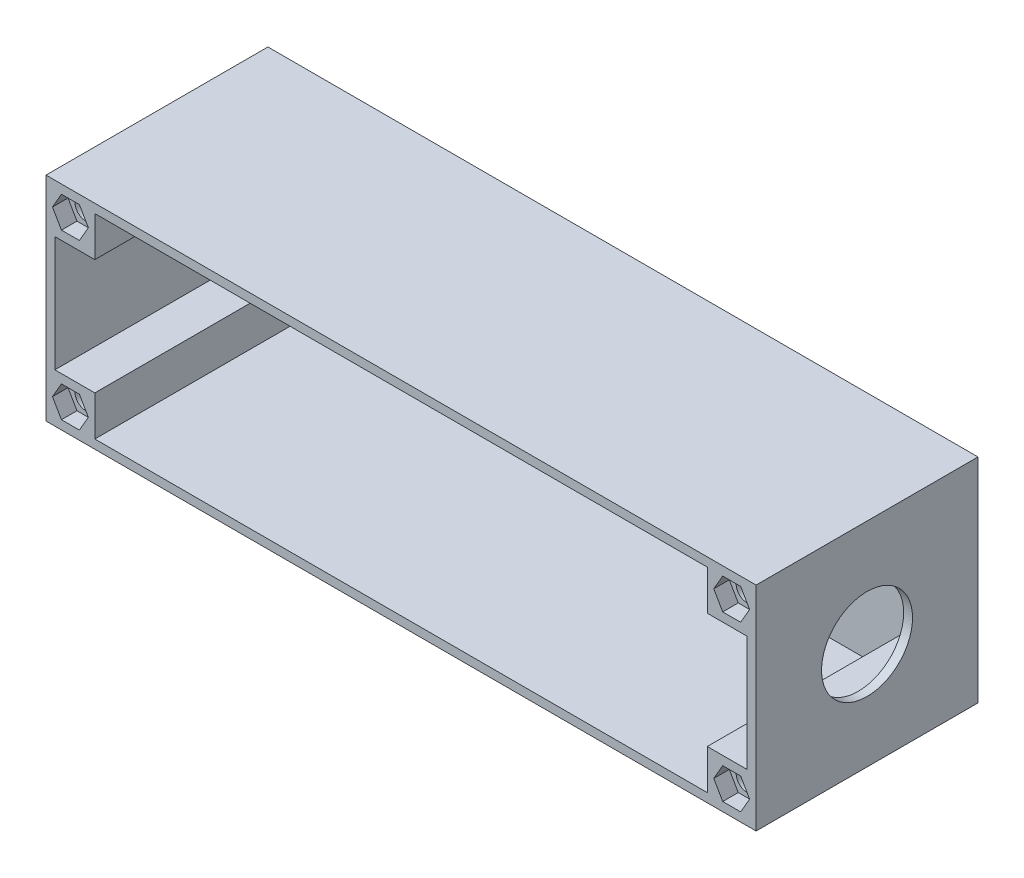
from build123d import *

# Parameters (mm, degrees)
SKIZZE1_W                       = 160
SKIZZE1_H                       = 48
AUFSATZ_LINEAR_AUSTRAGEN2_DEPTH = 50
SCHNITT_LINEAR_AUSTRAGEN1_DEPTH = 44
SKIZZE3_R                       = 10.25
SCHNITT_LINEAR_AUSTRAGEN2_DEPTH = 3
SKIZZE4_R                       = 13
SCHNITT_LINEAR_AUSTRAGEN3_DEPTH = 4
SCHNITT_LINEAR_AUSTRAGEN4_DEPTH = 3.5
SKIZZE8_R                       = 2.5
SCHNITT_LINEAR_AUSTRAGEN5_DEPTH = 10
SCHNITT_LINEAR_AUSTRAGEN6_DEPTH = 13.5


with BuildPart() as part:
    # Skizze1 → Aufsatz-Linear austragen2 (new body)
    with BuildSketch(Plane.XY):
        with Locations((80, 24)):
            Rectangle(SKIZZE1_W, SKIZZE1_H)
    extrude(amount=AUFSATZ_LINEAR_AUSTRAGEN2_DEPTH)

    # Skizze2 → Schnitt-Linear austragen1 (cut)
    with BuildSketch(Plane.XY.offset(50)):
        Polygon((11, 46), (149, 46), (149, 37), (158, 37), (158, 11), (149, 11), (149, 2), (11, 2), (11, 11), (2, 11), (2, 37), (11, 37), align=None)
    extrude(amount=-SCHNITT_LINEAR_AUSTRAGEN1_DEPTH, mode=Mode.SUBTRACT)

    # Skizze3 → Schnitt-Linear austragen2 (cut)
    with BuildSketch(Plane(origin=(160, 0, 0), x_dir=(0, 0, -1), z_dir=(1, 0, 0))):
        with Locations((-25, 24)):
            Circle(SKIZZE3_R)
    extrude(amount=-SCHNITT_LINEAR_AUSTRAGEN2_DEPTH, mode=Mode.SUBTRACT)

    # Skizze4 → Schnitt-Linear austragen3 (cut)
    with BuildSketch(Plane(origin=(0, 0, 0), x_dir=(-1, 0, 0), z_dir=(0, 0, -1))):
        with Locations((-120, 24)):
            Circle(SKIZZE4_R)
        with Locations((-40, 24)):
            Circle(SKIZZE4_R)
    extrude(amount=-SCHNITT_LINEAR_AUSTRAGEN3_DEPTH, mode=Mode.SUBTRACT)

    # Skizze6 → Schnitt-Linear austragen4 (cut)
    with BuildSketch(Plane.XY.offset(50)):
        Polygon((9.541451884, 42.5), (7.520725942, 46), (3.479274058, 46), (1.458548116, 42.5), (3.479274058, 39), (7.520725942, 39), align=None)
        Polygon((152.479274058, 39), (150.458548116, 42.5), (152.479274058, 46), (156.520725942, 46), (158.541451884, 42.5), (156.520725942, 39), align=None)
        Polygon((7.520725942, 9), (9.541451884, 5.5), (7.520725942, 2), (3.479274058, 2), (1.458548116, 5.5), (3.479274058, 9), align=None)
        Polygon((156.520725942, 9), (152.479274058, 9), (150.458548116, 5.5), (152.479274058, 2), (156.520725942, 2), (158.541451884, 5.5), align=None)
    extrude(amount=-SCHNITT_LINEAR_AUSTRAGEN4_DEPTH, mode=Mode.SUBTRACT)

    # Skizze8 → Schnitt-Linear austragen5 (cut)
    with BuildSketch(Plane.XY.offset(50)):
        with Locations((5.5, 42.5)):
            Circle(SKIZZE8_R)
        with Locations(Location((154.5, 42.5, 0), (0, 0, 180))):
            Circle(SKIZZE8_R)
        with Locations((154.5, 5.5)):
            Circle(SKIZZE8_R)
        with Locations(Location((5.5, 5.5, 0), (0, 0, 180))):
            Circle(SKIZZE8_R)
    extrude(amount=-SCHNITT_LINEAR_AUSTRAGEN5_DEPTH, mode=Mode.SUBTRACT)

    # Skizze9 → Schnitt-Linear austragen6 (cut)
    with BuildSketch(Plane(origin=(0, 0, 0), x_dir=(-1, 0, 0), z_dir=(0, 0, -1))):
        with BuildLine():
            Line((-144.5, 26.5), (-141.5, 26.5))
            ThreePointArc((-141.5, 26.5), (-139, 24), (-141.5, 21.5))
            Line((-141.5, 21.5), (-144.5, 21.5))
            ThreePointArc((-144.5, 21.5), (-147, 24), (-144.5, 26.5))
        make_face()
        with BuildLine():
            Line((-15.5, 26.5), (-18.5, 26.5))
            ThreePointArc((-18.5, 26.5), (-21, 24), (-18.5, 21.5))
            Line((-18.5, 21.5), (-15.5, 21.5))
            ThreePointArc((-15.5, 21.5), (-13, 24), (-15.5, 26.5))
        make_face()
    extrude(amount=-SCHNITT_LINEAR_AUSTRAGEN6_DEPTH, mode=Mode.SUBTRACT)


solid = part.part
